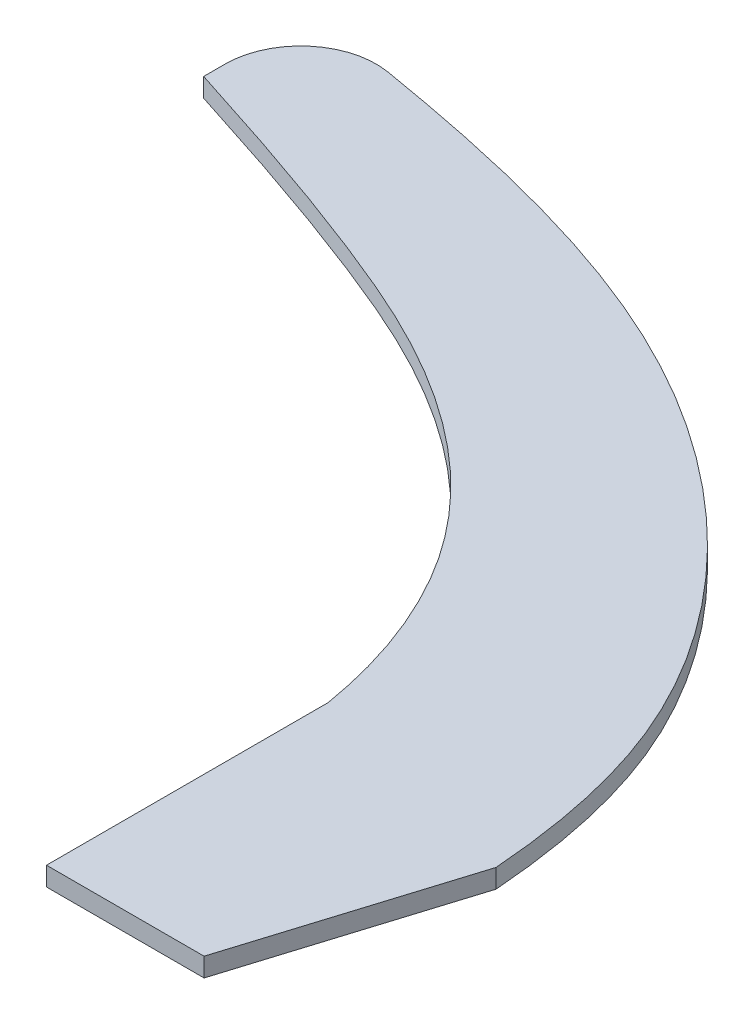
from build123d import *

# Parameters (mm, degrees)
EXTRUDE1_DEPTH = 6.35


with BuildPart() as part:
    # Sketch1 → Extrude1 (new body)
    with BuildSketch(Plane(origin=(0, 0, 0), x_dir=(1, 0, 0), z_dir=(0, 1, 0))):
        with BuildLine():
            Line((-19.905319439, 48.26), (-72.880212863, 48.26))
            Line((-72.880212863, 48.26), (-72.880212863, 142.977188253))
            add(Edge.make_bspline(
                [(-72.880212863, 142.977188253), (-75.089486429, 155.984810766), (-80.162520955, 174.044765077), (-106.217359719, 225.42420478), (-147.777683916, 255.872844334), (-215.313087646, 284.497873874), (-249.397028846, 295.816675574), (-276.080212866, 304.304256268)],
                knots=[0.204924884, 0.204924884, 0.204924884, 0.204924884, 0.2910447, 0.329596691, 0.561461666, 0.611079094, 0.796787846, 0.796787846, 0.796787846, 0.796787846], degree=3))
            Line((-276.080212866, 304.304256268), (-276.080212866, 311.525639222))
            ThreePointArc((-276.080212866, 311.525639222), (-267.0780752, 330.923322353), (-246.452645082, 336.571350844))
            add(Edge.make_bspline(
                [(3.319787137, 123.182472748), (1.729959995, 144.350911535), (-10.637747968, 212.558405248), (-101.308396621, 305.399197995), (-196.449017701, 328.131034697), (-246.452645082, 336.571350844)],
                knots=[0.156420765, 0.156420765, 0.156420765, 0.156420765, 0.291931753, 0.5959683, 0.916312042, 0.916312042, 0.916312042, 0.916312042], degree=3))
            Line((3.319787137, 123.182472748), (-19.905319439, 48.26))
        make_face()
    extrude(amount=EXTRUDE1_DEPTH)


solid = part.part
